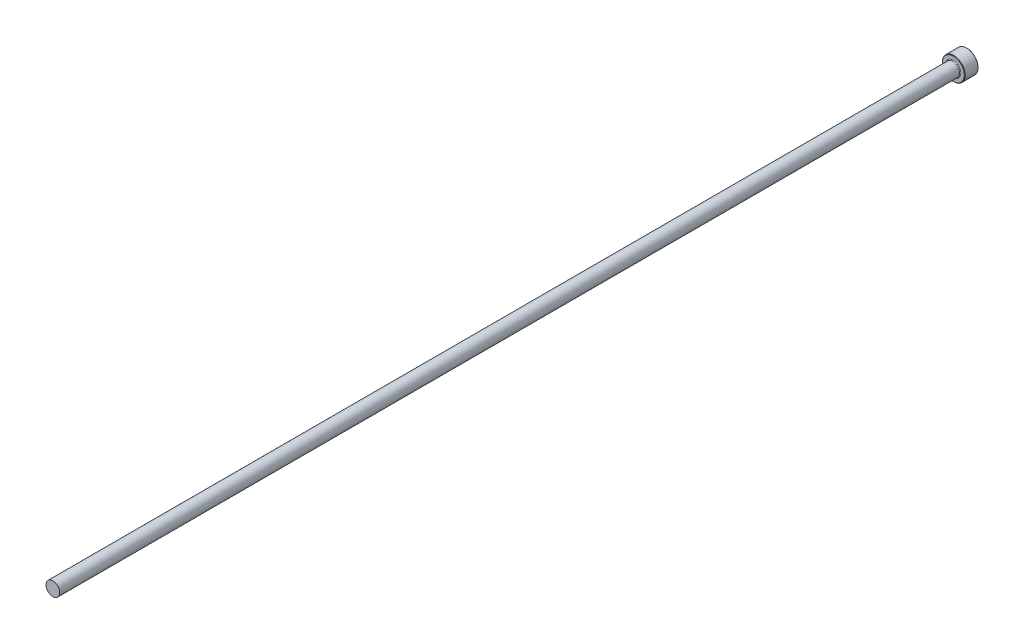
from build123d import *

# Parameters (mm, degrees)
CHAMFER1_SIZE = 0.2


with BuildPart() as part:
    # Sketch1 → Revolve1 (revolve)
    with BuildSketch(Plane(origin=(0, 0, 0), x_dir=(0, 0, -1), z_dir=(1, 0, 0)), mode=Mode.PRIVATE) as revolve1_sk:
        with BuildLine():
            Line((0, 0), (0, 5))
            Line((0, 5), (-6, 5))
            Line((-6, 5), (-6, 3.3))
            ThreePointArc((-6, 3.3), (-6.087867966, 3.087867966), (-6.3, 3))
            Line((-6.3, 3), (-400, 3))
            Line((-400, 3), (-400, 0))
            Line((-400, 0), (0, 0))
        make_face()
    revolve(revolve1_sk.sketch.rotate(Axis((0, 0, 109.05062828), (0, 0, -1)), 90), axis=Axis((0, 0, 109.05062828), (0, 0, -1)))

    # Chamfer1
    chamfer1_edges = [part.edges().sort_by_distance(p)[0] for p in [
        (-5, 0, 0),
        (-5, 0, 6),
    ]]
    chamfer(chamfer1_edges, length=CHAMFER1_SIZE)


solid = part.part
